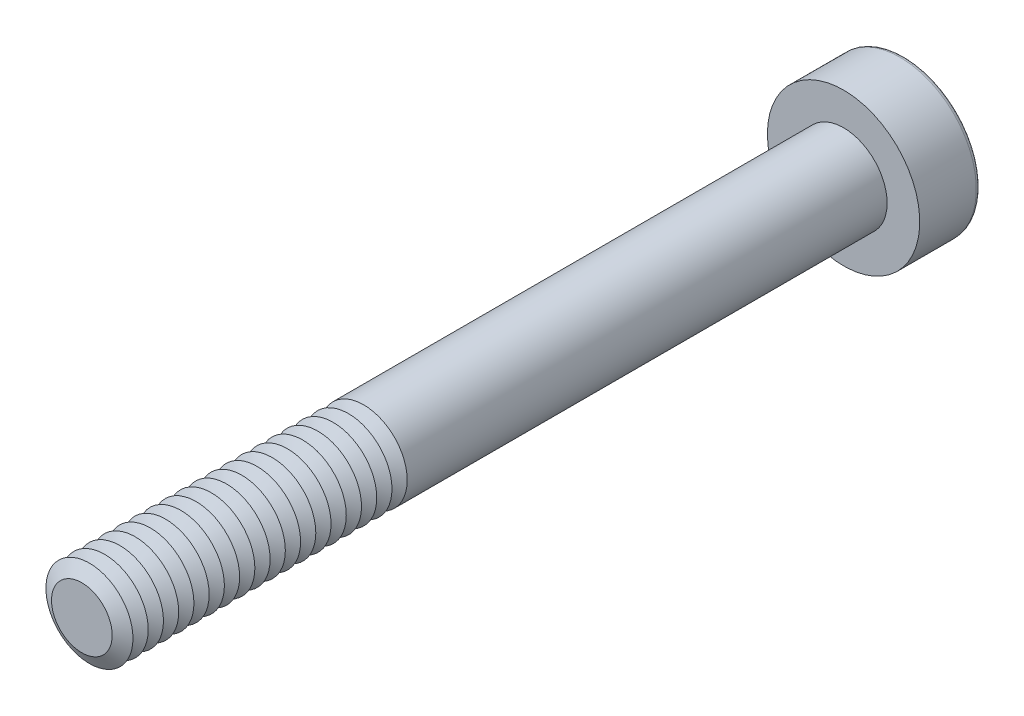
from build123d import *

# Parameters (mm, degrees)
SKETCH1_R           = 2
BOSS_EXTRUDE1_DEPTH = 35
SKETCH2_R           = 3.5
BOSS_EXTRUDE2_DEPTH = 2.8
CUT_EXTRUDE1_DEPTH  = 1.875
FILLET1_R           = 0.2
LPATTERN1_COUNT     = 19
LPATTERN1_PITCH     = 0.7


with BuildPart() as part:
    # Sketch1 → Boss-Extrude1 (new body)
    with BuildSketch(Plane.XY):
        Circle(SKETCH1_R)
    extrude(amount=BOSS_EXTRUDE1_DEPTH)

    # Sketch2 → Boss-Extrude2 (add)
    with BuildSketch(Plane(origin=(0, 0, 0), x_dir=(-1, 0, 0), z_dir=(0, 0, -1))):
        Circle(SKETCH2_R)
    extrude(amount=BOSS_EXTRUDE2_DEPTH)

    # Sketch3 → Cut-Extrude1 (cut)
    with BuildSketch(Plane(origin=(0, 0, -2.8), x_dir=(-1, 0, 0), z_dir=(0, 0, -1))):
        Polygon((-0.721687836, 1.25), (-1.443375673, 0), (-0.721687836, -1.25), (0.721687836, -1.25), (1.443375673, 0), (0.721687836, 1.25), align=None)
    extrude(amount=-CUT_EXTRUDE1_DEPTH, mode=Mode.SUBTRACT)

    # Fillet1
    fillet1_edges = [part.edges().sort_by_distance(p)[0] for p in [
        (3.5, 0, -2.8),
    ]]
    fillet(fillet1_edges, radius=FILLET1_R)

    # Cut-Extrude2 cone 1 section (on through the dimple's axis) → Cut-Extrude2 (revolve, cut)
    with BuildSketch(Plane(origin=(0, 0, -0.925), x_dir=(0, 1, 0), z_dir=(1, 0, 0))):
        Polygon((0, 0), (1.25, 0), (0, 0.721687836), align=None)
    revolve(axis=Axis((0, 0, -0.925), (0, 0, 1)), mode=Mode.SUBTRACT)

    # Cut-Extrude3 cone 1 section (on through the dimple's axis) → Cut-Extrude3 (revolve, cut)
    with BuildSketch(Plane(origin=(0, 0, -2.8), x_dir=(0, 1, 0), z_dir=(1, 0, 0))):
        Polygon((0, 0), (1.443375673, 0), (0, 0.386751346), align=None)
    revolve(axis=Axis((0, 0, -2.8), (0, 0, 1)), mode=Mode.SUBTRACT)

    # Sketch7 → Cut-Revolve1 (revolve, cut)
    with BuildSketch(Plane(origin=(0, 0, 0), x_dir=(0, 0, -1), z_dir=(1, 0, 0)), mode=Mode.PRIVATE) as cut_revolve1_sk:
        Polygon((-35, 1.393782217), (-34.65, 2), (-35.35, 2), align=None)
    cut_revolve1 = revolve(cut_revolve1_sk.sketch.rotate(Axis((0, 0, 35), (0, 0, -1)), 90), axis=Axis((0, 0, 35), (0, 0, -1)), mode=Mode.SUBTRACT)

    # LPattern1: Cut-Revolve1 ×19
    with Locations(*[(0, 0, -i * LPATTERN1_PITCH) for i in range(1, LPATTERN1_COUNT)]):
        add(cut_revolve1, mode=Mode.SUBTRACT)


solid = part.part
